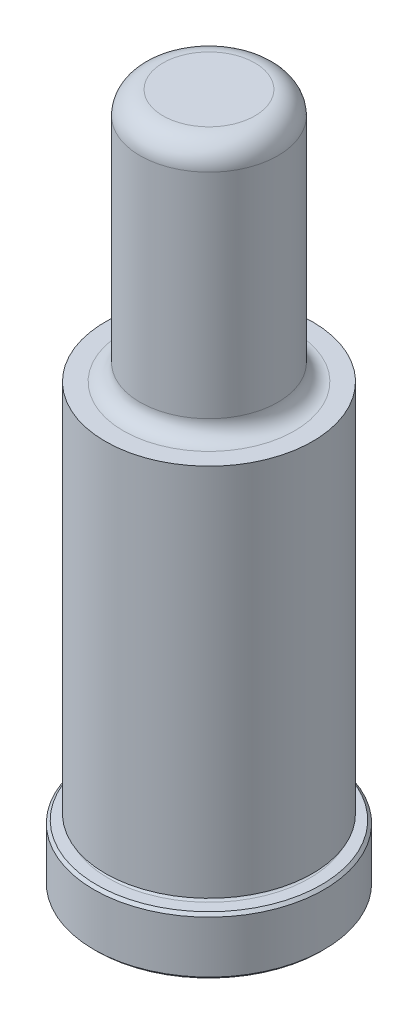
ISO-10303-21;
HEADER;
FILE_DESCRIPTION(('STEP AP214'),'2;1');
FILE_NAME('part.step','',(''),(''),'','','');
FILE_SCHEMA(('AUTOMOTIVE_DESIGN { 1 0 10303 214 1 1 1 1 }'));
ENDSEC;
DATA;
#1=APPLICATION_CONTEXT('core data for automotive mechanical design processes');
#2=APPLICATION_PROTOCOL_DEFINITION('international standard','automotive_design',2000,#1);
#3=PRODUCT_CONTEXT('',#1,'mechanical');
#4=PRODUCT('Part','Part','',(#3));
#5=PRODUCT_RELATED_PRODUCT_CATEGORY('part','',(#4));
#6=PRODUCT_DEFINITION_FORMATION('','',#4);
#7=PRODUCT_DEFINITION_CONTEXT('part definition',#1,'design');
#8=PRODUCT_DEFINITION('design','',#6,#7);
#9=PRODUCT_DEFINITION_SHAPE('','',#8);
#10=(LENGTH_UNIT() NAMED_UNIT(*) SI_UNIT(.MILLI.,.METRE.));
#11=(NAMED_UNIT(*) PLANE_ANGLE_UNIT() SI_UNIT($,.RADIAN.));
#12=(NAMED_UNIT(*) SI_UNIT($,.STERADIAN.) SOLID_ANGLE_UNIT());
#13=UNCERTAINTY_MEASURE_WITH_UNIT(LENGTH_MEASURE(1.E-05),#10,'distance_accuracy_value','');
#14=(GEOMETRIC_REPRESENTATION_CONTEXT(3) GLOBAL_UNCERTAINTY_ASSIGNED_CONTEXT((#13)) GLOBAL_UNIT_ASSIGNED_CONTEXT((#10,
#11,#12)) REPRESENTATION_CONTEXT('',''));
#15=CARTESIAN_POINT('',(0.,0.,0.));
#16=DIRECTION('',(0.,0.,1.));
#17=DIRECTION('',(1.,0.,0.));
#18=AXIS2_PLACEMENT_3D('',#15,#16,#17);
#19=CARTESIAN_POINT('',(0.,0.,0.));
#20=DIRECTION('',(0.,1.,0.));
#21=DIRECTION('',(0.,0.,1.));
#22=AXIS2_PLACEMENT_3D('',#19,#20,#21);
#23=PLANE('',#22);
#24=CARTESIAN_POINT('',(0.,0.,0.));
#25=DIRECTION('',(0.,1.,0.));
#26=DIRECTION('',(0.,0.,1.));
#27=AXIS2_PLACEMENT_3D('',#24,#25,#26);
#28=CIRCLE('',#27,15.494);
#29=CARTESIAN_POINT('',(0.,0.,15.494));
#30=VERTEX_POINT('',#29);
#31=EDGE_CURVE('E45',#30,#30,#28,.F.);
#32=ORIENTED_EDGE('',*,*,#31,.T.);
#33=EDGE_LOOP('',(#32));
#34=FACE_BOUND('',#33,.T.);
#35=ADVANCED_FACE('F30',(#34),#23,.F.);
#36=CARTESIAN_POINT('',(0.,0.,0.));
#37=DIRECTION('',(0.,1.,0.));
#38=DIRECTION('',(0.,0.,1.));
#39=AXIS2_PLACEMENT_3D('',#36,#37,#38);
#40=CYLINDRICAL_SURFACE('',#39,15.875);
#41=CARTESIAN_POINT('',(0.,0.380999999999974,0.));
#42=DIRECTION('',(0.,1.,0.));
#43=DIRECTION('',(0.,0.,1.));
#44=AXIS2_PLACEMENT_3D('',#41,#42,#43);
#45=CIRCLE('',#44,15.875);
#46=CARTESIAN_POINT('',(0.,0.380999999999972,15.875));
#47=VERTEX_POINT('',#46);
#48=EDGE_CURVE('E50',#47,#47,#45,.T.);
#49=ORIENTED_EDGE('',*,*,#48,.T.);
#50=EDGE_LOOP('',(#49));
#51=FACE_BOUND('',#50,.T.);
#52=CARTESIAN_POINT('',(0.,7.54380000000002,0.));
#53=DIRECTION('',(0.,-1.,0.));
#54=DIRECTION('',(0.,0.,-1.));
#55=AXIS2_PLACEMENT_3D('',#52,#53,#54);
#56=CIRCLE('',#55,15.875);
#57=CARTESIAN_POINT('',(0.,7.54380000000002,-15.875));
#58=VERTEX_POINT('',#57);
#59=EDGE_CURVE('E53',#58,#58,#56,.T.);
#60=ORIENTED_EDGE('',*,*,#59,.T.);
#61=EDGE_LOOP('',(#60));
#62=FACE_BOUND('',#61,.T.);
#63=ADVANCED_FACE('F109',(#51,#62),#40,.T.);
#64=CARTESIAN_POINT('',(0.,7.9248,-15.875));
#65=DIRECTION('',(0.,-1.,0.));
#66=DIRECTION('',(0.,0.,-1.));
#67=AXIS2_PLACEMENT_3D('',#64,#65,#66);
#68=PLANE('',#67);
#69=CARTESIAN_POINT('',(0.,7.9248,0.));
#70=DIRECTION('',(0.,-1.,0.));
#71=DIRECTION('',(0.,0.,-1.));
#72=AXIS2_PLACEMENT_3D('',#69,#70,#71);
#73=CIRCLE('',#72,15.494);
#74=CARTESIAN_POINT('',(0.,7.9248,-15.494));
#75=VERTEX_POINT('',#74);
#76=EDGE_CURVE('E41',#75,#75,#73,.F.);
#77=ORIENTED_EDGE('',*,*,#76,.T.);
#78=EDGE_LOOP('',(#77));
#79=FACE_BOUND('',#78,.T.);
#80=CARTESIAN_POINT('',(0.,7.9248,0.));
#81=DIRECTION('',(0.,1.,0.));
#82=DIRECTION('',(0.,0.,1.));
#83=AXIS2_PLACEMENT_3D('',#80,#81,#82);
#84=CIRCLE('',#83,13.8938);
#85=CARTESIAN_POINT('',(0.,7.9248,13.8938));
#86=VERTEX_POINT('',#85);
#87=EDGE_CURVE('E56',#86,#86,#84,.T.);
#88=ORIENTED_EDGE('',*,*,#87,.F.);
#89=EDGE_LOOP('',(#88));
#90=FACE_BOUND('',#89,.T.);
#91=ADVANCED_FACE('F104',(#79,#90),#68,.F.);
#92=CARTESIAN_POINT('',(0.,8.3058,0.));
#93=DIRECTION('',(0.,1.,0.));
#94=DIRECTION('',(0.,0.,1.));
#95=AXIS2_PLACEMENT_3D('',#92,#93,#94);
#96=TOROIDAL_SURFACE('',#95,13.8938,0.381000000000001);
#97=CARTESIAN_POINT('',(0.,8.68680000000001,0.));
#98=DIRECTION('',(0.,1.,0.));
#99=DIRECTION('',(0.,0.,1.));
#100=AXIS2_PLACEMENT_3D('',#97,#98,#99);
#101=CIRCLE('',#100,13.8938);
#102=CARTESIAN_POINT('',(0.,8.6868,13.8938));
#103=VERTEX_POINT('',#102);
#104=EDGE_CURVE('E59',#103,#103,#101,.T.);
#105=ORIENTED_EDGE('',*,*,#104,.F.);
#106=EDGE_LOOP('',(#105));
#107=FACE_BOUND('',#106,.T.);
#108=ORIENTED_EDGE('',*,*,#87,.T.);
#109=EDGE_LOOP('',(#108));
#110=FACE_BOUND('',#109,.T.);
#111=ADVANCED_FACE('F98',(#107,#110),#96,.F.);
#112=CARTESIAN_POINT('',(0.,8.68680000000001,-13.8938));
#113=DIRECTION('',(0.,1.,0.));
#114=DIRECTION('',(0.,0.,1.));
#115=AXIS2_PLACEMENT_3D('',#112,#113,#114);
#116=PLANE('',#115);
#117=CARTESIAN_POINT('',(0.,8.6868,0.));
#118=DIRECTION('',(0.,1.,0.));
#119=DIRECTION('',(0.,0.,1.));
#120=AXIS2_PLACEMENT_3D('',#117,#118,#119);
#121=CIRCLE('',#120,14.3002);
#122=CARTESIAN_POINT('',(0.,8.6868,14.3002));
#123=VERTEX_POINT('',#122);
#124=EDGE_CURVE('E62',#123,#123,#121,.T.);
#125=ORIENTED_EDGE('',*,*,#124,.F.);
#126=EDGE_LOOP('',(#125));
#127=FACE_BOUND('',#126,.T.);
#128=ORIENTED_EDGE('',*,*,#104,.T.);
#129=EDGE_LOOP('',(#128));
#130=FACE_BOUND('',#129,.T.);
#131=ADVANCED_FACE('F92',(#127,#130),#116,.F.);
#132=CARTESIAN_POINT('',(0.,0.,0.));
#133=DIRECTION('',(0.,1.,0.));
#134=DIRECTION('',(0.,0.,1.));
#135=AXIS2_PLACEMENT_3D('',#132,#133,#134);
#136=CYLINDRICAL_SURFACE('',#135,14.3002);
#137=CARTESIAN_POINT('',(0.,60.325,0.));
#138=DIRECTION('',(0.,1.,0.));
#139=DIRECTION('',(0.,0.,1.));
#140=AXIS2_PLACEMENT_3D('',#137,#138,#139);
#141=CIRCLE('',#140,14.3002);
#142=CARTESIAN_POINT('',(0.,60.325,14.3002));
#143=VERTEX_POINT('',#142);
#144=EDGE_CURVE('E65',#143,#143,#141,.T.);
#145=ORIENTED_EDGE('',*,*,#144,.F.);
#146=EDGE_LOOP('',(#145));
#147=FACE_BOUND('',#146,.T.);
#148=ORIENTED_EDGE('',*,*,#124,.T.);
#149=EDGE_LOOP('',(#148));
#150=FACE_BOUND('',#149,.T.);
#151=ADVANCED_FACE('F86',(#147,#150),#136,.T.);
#152=CARTESIAN_POINT('',(0.,60.325,-14.3002));
#153=DIRECTION('',(0.,-1.,0.));
#154=DIRECTION('',(0.,0.,-1.));
#155=AXIS2_PLACEMENT_3D('',#152,#153,#154);
#156=PLANE('',#155);
#157=CARTESIAN_POINT('',(0.,60.325,0.));
#158=DIRECTION('',(0.,1.,0.));
#159=DIRECTION('',(0.,0.,1.));
#160=AXIS2_PLACEMENT_3D('',#157,#158,#159);
#161=CIRCLE('',#160,11.7983);
#162=CARTESIAN_POINT('',(0.,60.325,11.7983));
#163=VERTEX_POINT('',#162);
#164=EDGE_CURVE('E68',#163,#163,#161,.T.);
#165=ORIENTED_EDGE('',*,*,#164,.F.);
#166=EDGE_LOOP('',(#165));
#167=FACE_BOUND('',#166,.T.);
#168=ORIENTED_EDGE('',*,*,#144,.T.);
#169=EDGE_LOOP('',(#168));
#170=FACE_BOUND('',#169,.T.);
#171=ADVANCED_FACE('F80',(#167,#170),#156,.F.);
#172=CARTESIAN_POINT('',(0.,62.611,0.));
#173=DIRECTION('',(0.,1.,0.));
#174=DIRECTION('',(0.,0.,1.));
#175=AXIS2_PLACEMENT_3D('',#172,#173,#174);
#176=TOROIDAL_SURFACE('',#175,11.7983,2.286);
#177=CARTESIAN_POINT('',(0.,62.611,0.));
#178=DIRECTION('',(0.,1.,0.));
#179=DIRECTION('',(0.,0.,1.));
#180=AXIS2_PLACEMENT_3D('',#177,#178,#179);
#181=CIRCLE('',#180,9.5123);
#182=CARTESIAN_POINT('',(0.,62.611,9.51230000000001));
#183=VERTEX_POINT('',#182);
#184=EDGE_CURVE('E71',#183,#183,#181,.T.);
#185=ORIENTED_EDGE('',*,*,#184,.F.);
#186=EDGE_LOOP('',(#185));
#187=FACE_BOUND('',#186,.T.);
#188=ORIENTED_EDGE('',*,*,#164,.T.);
#189=EDGE_LOOP('',(#188));
#190=FACE_BOUND('',#189,.T.);
#191=ADVANCED_FACE('F77',(#187,#190),#176,.F.);
#192=CARTESIAN_POINT('',(0.,0.,0.));
#193=DIRECTION('',(0.,1.,0.));
#194=DIRECTION('',(0.,0.,1.));
#195=AXIS2_PLACEMENT_3D('',#192,#193,#194);
#196=CYLINDRICAL_SURFACE('',#195,9.5123);
#197=CARTESIAN_POINT('',(0.,92.075,0.));
#198=DIRECTION('',(0.,-1.,0.));
#199=DIRECTION('',(0.,0.,-1.));
#200=AXIS2_PLACEMENT_3D('',#197,#198,#199);
#201=CIRCLE('',#200,9.5123);
#202=CARTESIAN_POINT('',(0.,92.075,-9.51229999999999));
#203=VERTEX_POINT('',#202);
#204=EDGE_CURVE('E10',#203,#203,#201,.T.);
#205=ORIENTED_EDGE('',*,*,#204,.T.);
#206=EDGE_LOOP('',(#205));
#207=FACE_BOUND('',#206,.T.);
#208=ORIENTED_EDGE('',*,*,#184,.T.);
#209=EDGE_LOOP('',(#208));
#210=FACE_BOUND('',#209,.T.);
#211=ADVANCED_FACE('F75',(#207,#210),#196,.T.);
#212=CARTESIAN_POINT('',(0.,95.25,-9.51229999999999));
#213=DIRECTION('',(0.,-1.,0.));
#214=DIRECTION('',(0.,0.,-1.));
#215=AXIS2_PLACEMENT_3D('',#212,#213,#214);
#216=PLANE('',#215);
#217=CARTESIAN_POINT('',(0.,95.25,0.));
#218=DIRECTION('',(0.,-1.,0.));
#219=DIRECTION('',(0.,0.,-1.));
#220=AXIS2_PLACEMENT_3D('',#217,#218,#219);
#221=CIRCLE('',#220,6.3373);
#222=CARTESIAN_POINT('',(0.,95.25,-6.33729999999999));
#223=VERTEX_POINT('',#222);
#224=EDGE_CURVE('E37',#223,#223,#221,.F.);
#225=ORIENTED_EDGE('',*,*,#224,.T.);
#226=EDGE_LOOP('',(#225));
#227=FACE_BOUND('',#226,.T.);
#228=ADVANCED_FACE('F126',(#227),#216,.F.);
#229=CARTESIAN_POINT('',(0.,0.380999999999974,0.));
#230=DIRECTION('',(0.,1.,0.));
#231=DIRECTION('',(0.,0.,1.));
#232=AXIS2_PLACEMENT_3D('',#229,#230,#231);
#233=CONICAL_SURFACE('',#232,15.875,0.785398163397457);
#234=ORIENTED_EDGE('',*,*,#31,.F.);
#235=EDGE_LOOP('',(#234));
#236=FACE_BOUND('',#235,.T.);
#237=ORIENTED_EDGE('',*,*,#48,.F.);
#238=EDGE_LOOP('',(#237));
#239=FACE_BOUND('',#238,.T.);
#240=ADVANCED_FACE('F123',(#236,#239),#233,.T.);
#241=CARTESIAN_POINT('',(0.,7.9248,0.));
#242=DIRECTION('',(0.,-1.,0.));
#243=DIRECTION('',(0.,0.,-1.));
#244=AXIS2_PLACEMENT_3D('',#241,#242,#243);
#245=CONICAL_SURFACE('',#244,15.494,0.785398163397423);
#246=ORIENTED_EDGE('',*,*,#59,.F.);
#247=EDGE_LOOP('',(#246));
#248=FACE_BOUND('',#247,.T.);
#249=ORIENTED_EDGE('',*,*,#76,.F.);
#250=EDGE_LOOP('',(#249));
#251=FACE_BOUND('',#250,.T.);
#252=ADVANCED_FACE('F125',(#248,#251),#245,.T.);
#253=CARTESIAN_POINT('',(0.,92.075,0.));
#254=DIRECTION('',(0.,-1.,0.));
#255=DIRECTION('',(0.,0.,-1.));
#256=AXIS2_PLACEMENT_3D('',#253,#254,#255);
#257=TOROIDAL_SURFACE('',#256,6.3373,3.175);
#258=ORIENTED_EDGE('',*,*,#204,.F.);
#259=EDGE_LOOP('',(#258));
#260=FACE_BOUND('',#259,.T.);
#261=ORIENTED_EDGE('',*,*,#224,.F.);
#262=EDGE_LOOP('',(#261));
#263=FACE_BOUND('',#262,.T.);
#264=ADVANCED_FACE('F32',(#260,#263),#257,.T.);
#265=CLOSED_SHELL('',(#35,#63,#91,#111,#131,#151,#171,#191,#211,#228,#240,#252,#264));
#266=MANIFOLD_SOLID_BREP('B2',#265);
#267=ADVANCED_BREP_SHAPE_REPRESENTATION('',(#18,#266),#14);
#268=SHAPE_DEFINITION_REPRESENTATION(#9,#267);
ENDSEC;
END-ISO-10303-21;
